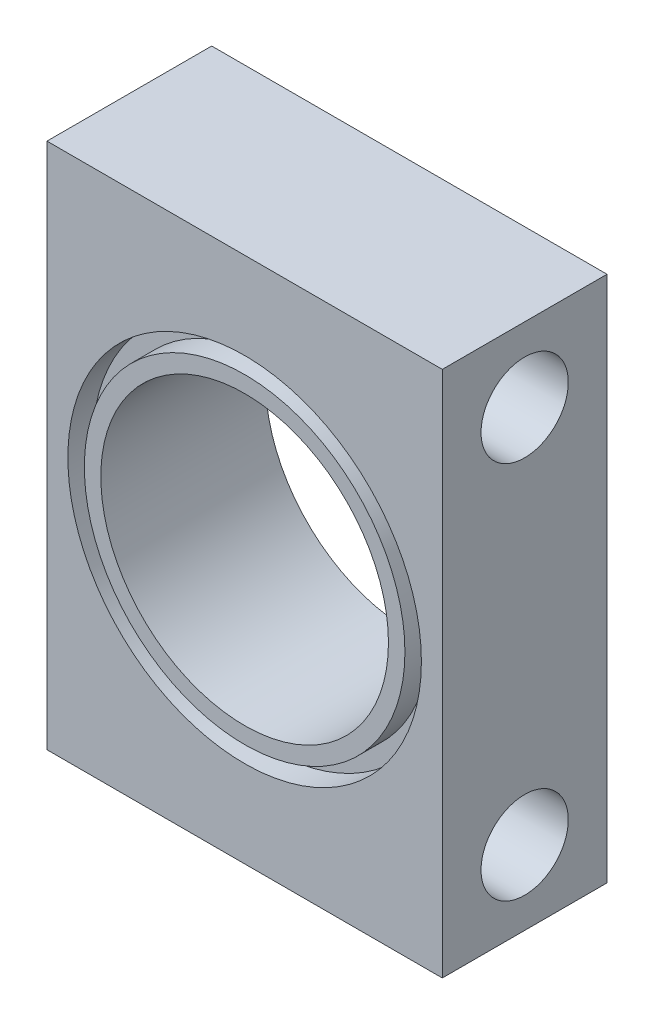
ISO-10303-21;
HEADER;
FILE_DESCRIPTION(('STEP AP214'),'2;1');
FILE_NAME('part.step','',(''),(''),'','','');
FILE_SCHEMA(('AUTOMOTIVE_DESIGN { 1 0 10303 214 1 1 1 1 }'));
ENDSEC;
DATA;
#1=APPLICATION_CONTEXT('core data for automotive mechanical design processes');
#2=APPLICATION_PROTOCOL_DEFINITION('international standard','automotive_design',2000,#1);
#3=PRODUCT_CONTEXT('',#1,'mechanical');
#4=PRODUCT('Part','Part','',(#3));
#5=PRODUCT_RELATED_PRODUCT_CATEGORY('part','',(#4));
#6=PRODUCT_DEFINITION_FORMATION('','',#4);
#7=PRODUCT_DEFINITION_CONTEXT('part definition',#1,'design');
#8=PRODUCT_DEFINITION('design','',#6,#7);
#9=PRODUCT_DEFINITION_SHAPE('','',#8);
#10=(LENGTH_UNIT() NAMED_UNIT(*) SI_UNIT(.MILLI.,.METRE.));
#11=(NAMED_UNIT(*) PLANE_ANGLE_UNIT() SI_UNIT($,.RADIAN.));
#12=(NAMED_UNIT(*) SI_UNIT($,.STERADIAN.) SOLID_ANGLE_UNIT());
#13=UNCERTAINTY_MEASURE_WITH_UNIT(LENGTH_MEASURE(1.E-05),#10,'distance_accuracy_value','');
#14=(GEOMETRIC_REPRESENTATION_CONTEXT(3) GLOBAL_UNCERTAINTY_ASSIGNED_CONTEXT((#13)) GLOBAL_UNIT_ASSIGNED_CONTEXT((#10,
#11,#12)) REPRESENTATION_CONTEXT('',''));
#15=CARTESIAN_POINT('',(0.,0.,0.));
#16=DIRECTION('',(0.,0.,1.));
#17=DIRECTION('',(1.,0.,0.));
#18=AXIS2_PLACEMENT_3D('',#15,#16,#17);
#19=CARTESIAN_POINT('',(12.,16.,5.));
#20=DIRECTION('',(0.,0.,-1.));
#21=DIRECTION('',(-1.,0.,0.));
#22=AXIS2_PLACEMENT_3D('',#19,#20,#21);
#23=PLANE('',#22);
#24=CARTESIAN_POINT('',(0.,0.,5.));
#25=DIRECTION('',(0.,0.,1.));
#26=DIRECTION('',(1.,0.,0.));
#27=AXIS2_PLACEMENT_3D('',#24,#25,#26);
#28=CIRCLE('',#27,8.73125);
#29=CARTESIAN_POINT('',(8.73125,0.,5.));
#30=VERTEX_POINT('',#29);
#31=EDGE_CURVE('E100',#30,#30,#28,.T.);
#32=ORIENTED_EDGE('',*,*,#31,.F.);
#33=EDGE_LOOP('',(#32));
#34=FACE_BOUND('',#33,.T.);
#35=CARTESIAN_POINT('',(0.,0.,5.));
#36=DIRECTION('',(0.,0.,1.));
#37=DIRECTION('',(1.,0.,0.));
#38=AXIS2_PLACEMENT_3D('',#35,#36,#37);
#39=CIRCLE('',#38,9.73125);
#40=CARTESIAN_POINT('',(9.73125,0.,5.));
#41=VERTEX_POINT('',#40);
#42=EDGE_CURVE('E140',#41,#41,#39,.T.);
#43=ORIENTED_EDGE('',*,*,#42,.T.);
#44=EDGE_LOOP('',(#43));
#45=FACE_BOUND('',#44,.T.);
#46=ADVANCED_FACE('F34',(#34,#45),#23,.F.);
#47=CARTESIAN_POINT('',(0.,0.,5.));
#48=DIRECTION('',(0.,0.,1.));
#49=DIRECTION('',(1.,0.,0.));
#50=AXIS2_PLACEMENT_3D('',#47,#48,#49);
#51=CIRCLE('',#50,10.73125);
#52=CARTESIAN_POINT('',(10.73125,0.,5.));
#53=VERTEX_POINT('',#52);
#54=EDGE_CURVE('E134',#53,#53,#51,.T.);
#55=ORIENTED_EDGE('',*,*,#54,.F.);
#56=EDGE_LOOP('',(#55));
#57=FACE_BOUND('',#56,.T.);
#58=DIRECTION('',(-1.,0.,0.));
#59=VECTOR('',#58,1.);
#60=CARTESIAN_POINT('',(0.,16.,5.));
#61=LINE('',#60,#59);
#62=CARTESIAN_POINT('',(12.,16.,5.));
#63=VERTEX_POINT('',#62);
#64=CARTESIAN_POINT('',(-12.,16.,5.));
#65=VERTEX_POINT('',#64);
#66=EDGE_CURVE('E79',#63,#65,#61,.T.);
#67=ORIENTED_EDGE('',*,*,#66,.T.);
#68=DIRECTION('',(0.,-1.,0.));
#69=VECTOR('',#68,1.);
#70=CARTESIAN_POINT('',(-12.,16.,5.));
#71=LINE('',#70,#69);
#72=CARTESIAN_POINT('',(-12.,-16.,5.));
#73=VERTEX_POINT('',#72);
#74=EDGE_CURVE('E82',#65,#73,#71,.T.);
#75=ORIENTED_EDGE('',*,*,#74,.T.);
#76=DIRECTION('',(1.,0.,0.));
#77=VECTOR('',#76,1.);
#78=CARTESIAN_POINT('',(-12.,-16.,5.));
#79=LINE('',#78,#77);
#80=CARTESIAN_POINT('',(12.,-16.,5.));
#81=VERTEX_POINT('',#80);
#82=EDGE_CURVE('E86',#73,#81,#79,.T.);
#83=ORIENTED_EDGE('',*,*,#82,.T.);
#84=DIRECTION('',(0.,1.,0.));
#85=VECTOR('',#84,1.);
#86=CARTESIAN_POINT('',(12.,16.,5.));
#87=LINE('',#86,#85);
#88=EDGE_CURVE('E51',#81,#63,#87,.T.);
#89=ORIENTED_EDGE('',*,*,#88,.T.);
#90=EDGE_LOOP('',(#67,#75,#83,#89));
#91=FACE_BOUND('',#90,.T.);
#92=ADVANCED_FACE('F84',(#57,#91),#23,.F.);
#93=CARTESIAN_POINT('',(12.,16.,-5.));
#94=DIRECTION('',(0.,0.,-1.));
#95=DIRECTION('',(-1.,0.,0.));
#96=AXIS2_PLACEMENT_3D('',#93,#94,#95);
#97=PLANE('',#96);
#98=DIRECTION('',(-1.,0.,0.));
#99=VECTOR('',#98,1.);
#100=CARTESIAN_POINT('',(0.,16.,-5.));
#101=LINE('',#100,#99);
#102=CARTESIAN_POINT('',(12.,16.,-5.));
#103=VERTEX_POINT('',#102);
#104=CARTESIAN_POINT('',(-12.,16.,-5.));
#105=VERTEX_POINT('',#104);
#106=EDGE_CURVE('E74',#103,#105,#101,.T.);
#107=ORIENTED_EDGE('',*,*,#106,.F.);
#108=DIRECTION('',(0.,1.,0.));
#109=VECTOR('',#108,1.);
#110=CARTESIAN_POINT('',(12.,16.,-5.));
#111=LINE('',#110,#109);
#112=CARTESIAN_POINT('',(12.,-16.,-5.));
#113=VERTEX_POINT('',#112);
#114=EDGE_CURVE('E103',#113,#103,#111,.T.);
#115=ORIENTED_EDGE('',*,*,#114,.F.);
#116=DIRECTION('',(1.,0.,0.));
#117=VECTOR('',#116,1.);
#118=CARTESIAN_POINT('',(0.,-16.,-5.));
#119=LINE('',#118,#117);
#120=CARTESIAN_POINT('',(-12.,-16.,-5.));
#121=VERTEX_POINT('',#120);
#122=EDGE_CURVE('E67',#121,#113,#119,.T.);
#123=ORIENTED_EDGE('',*,*,#122,.F.);
#124=DIRECTION('',(0.,-1.,0.));
#125=VECTOR('',#124,1.);
#126=CARTESIAN_POINT('',(-12.,16.,-5.));
#127=LINE('',#126,#125);
#128=EDGE_CURVE('E91',#105,#121,#127,.T.);
#129=ORIENTED_EDGE('',*,*,#128,.F.);
#130=EDGE_LOOP('',(#107,#115,#123,#129));
#131=FACE_BOUND('',#130,.T.);
#132=CARTESIAN_POINT('',(0.,0.,-5.));
#133=DIRECTION('',(0.,0.,1.));
#134=DIRECTION('',(1.,0.,0.));
#135=AXIS2_PLACEMENT_3D('',#132,#133,#134);
#136=CIRCLE('',#135,8.73125);
#137=CARTESIAN_POINT('',(8.73125,0.,-5.));
#138=VERTEX_POINT('',#137);
#139=EDGE_CURVE('E115',#138,#138,#136,.T.);
#140=ORIENTED_EDGE('',*,*,#139,.T.);
#141=EDGE_LOOP('',(#140));
#142=FACE_BOUND('',#141,.T.);
#143=ADVANCED_FACE('F109',(#131,#142),#97,.T.);
#144=CARTESIAN_POINT('',(0.,16.,5.));
#145=DIRECTION('',(0.,-1.,0.));
#146=DIRECTION('',(0.,0.,-1.));
#147=AXIS2_PLACEMENT_3D('',#144,#145,#146);
#148=PLANE('',#147);
#149=ORIENTED_EDGE('',*,*,#106,.T.);
#150=DIRECTION('',(0.,0.,-1.));
#151=VECTOR('',#150,1.);
#152=CARTESIAN_POINT('',(-12.,16.,5.));
#153=LINE('',#152,#151);
#154=EDGE_CURVE('E11',#65,#105,#153,.T.);
#155=ORIENTED_EDGE('',*,*,#154,.F.);
#156=ORIENTED_EDGE('',*,*,#66,.F.);
#157=DIRECTION('',(0.,0.,-1.));
#158=VECTOR('',#157,1.);
#159=CARTESIAN_POINT('',(12.,16.,5.));
#160=LINE('',#159,#158);
#161=EDGE_CURVE('E95',#63,#103,#160,.T.);
#162=ORIENTED_EDGE('',*,*,#161,.T.);
#163=EDGE_LOOP('',(#149,#155,#156,#162));
#164=FACE_BOUND('',#163,.T.);
#165=ADVANCED_FACE('F36',(#164),#148,.F.);
#166=CARTESIAN_POINT('',(-12.,16.,5.));
#167=DIRECTION('',(1.,0.,0.));
#168=DIRECTION('',(0.,0.,-1.));
#169=AXIS2_PLACEMENT_3D('',#166,#167,#168);
#170=PLANE('',#169);
#171=CARTESIAN_POINT('',(-12.,11.5,0.));
#172=DIRECTION('',(1.,0.,0.));
#173=DIRECTION('',(0.,0.,-1.));
#174=AXIS2_PLACEMENT_3D('',#171,#172,#173);
#175=CIRCLE('',#174,2.64999999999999);
#176=CARTESIAN_POINT('',(-12.,11.5,-2.64999999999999));
#177=VERTEX_POINT('',#176);
#178=EDGE_CURVE('E127',#177,#177,#175,.T.);
#179=ORIENTED_EDGE('',*,*,#178,.T.);
#180=EDGE_LOOP('',(#179));
#181=FACE_BOUND('',#180,.T.);
#182=CARTESIAN_POINT('',(-12.,-11.5,0.));
#183=DIRECTION('',(1.,0.,0.));
#184=DIRECTION('',(0.,0.,-1.));
#185=AXIS2_PLACEMENT_3D('',#182,#183,#184);
#186=CIRCLE('',#185,2.64999999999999);
#187=CARTESIAN_POINT('',(-12.,-11.5,-2.64999999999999));
#188=VERTEX_POINT('',#187);
#189=EDGE_CURVE('E117',#188,#188,#186,.T.);
#190=ORIENTED_EDGE('',*,*,#189,.T.);
#191=EDGE_LOOP('',(#190));
#192=FACE_BOUND('',#191,.T.);
#193=ORIENTED_EDGE('',*,*,#128,.T.);
#194=DIRECTION('',(0.,0.,-1.));
#195=VECTOR('',#194,1.);
#196=CARTESIAN_POINT('',(-12.,-16.,5.));
#197=LINE('',#196,#195);
#198=EDGE_CURVE('E43',#73,#121,#197,.T.);
#199=ORIENTED_EDGE('',*,*,#198,.F.);
#200=ORIENTED_EDGE('',*,*,#74,.F.);
#201=ORIENTED_EDGE('',*,*,#154,.T.);
#202=EDGE_LOOP('',(#193,#199,#200,#201));
#203=FACE_BOUND('',#202,.T.);
#204=ADVANCED_FACE('F90',(#181,#192,#203),#170,.F.);
#205=CARTESIAN_POINT('',(0.,-16.,5.));
#206=DIRECTION('',(0.,1.,0.));
#207=DIRECTION('',(0.,0.,1.));
#208=AXIS2_PLACEMENT_3D('',#205,#206,#207);
#209=PLANE('',#208);
#210=ORIENTED_EDGE('',*,*,#122,.T.);
#211=DIRECTION('',(0.,0.,-1.));
#212=VECTOR('',#211,1.);
#213=CARTESIAN_POINT('',(12.,-16.,5.));
#214=LINE('',#213,#212);
#215=EDGE_CURVE('E92',#81,#113,#214,.T.);
#216=ORIENTED_EDGE('',*,*,#215,.F.);
#217=ORIENTED_EDGE('',*,*,#82,.F.);
#218=ORIENTED_EDGE('',*,*,#198,.T.);
#219=EDGE_LOOP('',(#210,#216,#217,#218));
#220=FACE_BOUND('',#219,.T.);
#221=ADVANCED_FACE('F93',(#220),#209,.F.);
#222=CARTESIAN_POINT('',(12.,16.,5.));
#223=DIRECTION('',(-1.,0.,0.));
#224=DIRECTION('',(0.,-1.,0.));
#225=AXIS2_PLACEMENT_3D('',#222,#223,#224);
#226=PLANE('',#225);
#227=CARTESIAN_POINT('',(12.,11.5,0.));
#228=DIRECTION('',(-1.,0.,0.));
#229=DIRECTION('',(0.,0.,1.));
#230=AXIS2_PLACEMENT_3D('',#227,#228,#229);
#231=CIRCLE('',#230,2.64999999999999);
#232=CARTESIAN_POINT('',(12.,11.5,2.64999999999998));
#233=VERTEX_POINT('',#232);
#234=EDGE_CURVE('E130',#233,#233,#231,.T.);
#235=ORIENTED_EDGE('',*,*,#234,.T.);
#236=EDGE_LOOP('',(#235));
#237=FACE_BOUND('',#236,.T.);
#238=CARTESIAN_POINT('',(12.,-11.5,0.));
#239=DIRECTION('',(-1.,0.,0.));
#240=DIRECTION('',(0.,0.,1.));
#241=AXIS2_PLACEMENT_3D('',#238,#239,#240);
#242=CIRCLE('',#241,2.64999999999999);
#243=CARTESIAN_POINT('',(12.,-11.5,2.64999999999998));
#244=VERTEX_POINT('',#243);
#245=EDGE_CURVE('E122',#244,#244,#242,.T.);
#246=ORIENTED_EDGE('',*,*,#245,.T.);
#247=EDGE_LOOP('',(#246));
#248=FACE_BOUND('',#247,.T.);
#249=ORIENTED_EDGE('',*,*,#114,.T.);
#250=ORIENTED_EDGE('',*,*,#161,.F.);
#251=ORIENTED_EDGE('',*,*,#88,.F.);
#252=ORIENTED_EDGE('',*,*,#215,.T.);
#253=EDGE_LOOP('',(#249,#250,#251,#252));
#254=FACE_BOUND('',#253,.T.);
#255=ADVANCED_FACE('F108',(#237,#248,#254),#226,.F.);
#256=CARTESIAN_POINT('',(0.,0.,5.));
#257=DIRECTION('',(0.,0.,-1.));
#258=DIRECTION('',(-1.,0.,0.));
#259=AXIS2_PLACEMENT_3D('',#256,#257,#258);
#260=CYLINDRICAL_SURFACE('',#259,8.73125);
#261=ORIENTED_EDGE('',*,*,#31,.T.);
#262=EDGE_LOOP('',(#261));
#263=FACE_BOUND('',#262,.T.);
#264=ORIENTED_EDGE('',*,*,#139,.F.);
#265=EDGE_LOOP('',(#264));
#266=FACE_BOUND('',#265,.T.);
#267=ADVANCED_FACE('F169',(#263,#266),#260,.F.);
#268=CARTESIAN_POINT('',(-13.4,-11.5,0.));
#269=DIRECTION('',(-1.,0.,0.));
#270=DIRECTION('',(0.,0.,1.));
#271=AXIS2_PLACEMENT_3D('',#268,#269,#270);
#272=CYLINDRICAL_SURFACE('',#271,2.64999999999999);
#273=ORIENTED_EDGE('',*,*,#245,.F.);
#274=EDGE_LOOP('',(#273));
#275=FACE_BOUND('',#274,.T.);
#276=ORIENTED_EDGE('',*,*,#189,.F.);
#277=EDGE_LOOP('',(#276));
#278=FACE_BOUND('',#277,.T.);
#279=ADVANCED_FACE('F186',(#275,#278),#272,.F.);
#280=CARTESIAN_POINT('',(-13.4,11.5,0.));
#281=DIRECTION('',(-1.,0.,0.));
#282=DIRECTION('',(0.,0.,1.));
#283=AXIS2_PLACEMENT_3D('',#280,#281,#282);
#284=CYLINDRICAL_SURFACE('',#283,2.64999999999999);
#285=ORIENTED_EDGE('',*,*,#234,.F.);
#286=EDGE_LOOP('',(#285));
#287=FACE_BOUND('',#286,.T.);
#288=ORIENTED_EDGE('',*,*,#178,.F.);
#289=EDGE_LOOP('',(#288));
#290=FACE_BOUND('',#289,.T.);
#291=ADVANCED_FACE('F158',(#287,#290),#284,.F.);
#292=CARTESIAN_POINT('',(0.,0.,3.5));
#293=DIRECTION('',(0.,0.,1.));
#294=DIRECTION('',(1.,0.,0.));
#295=AXIS2_PLACEMENT_3D('',#292,#293,#294);
#296=CYLINDRICAL_SURFACE('',#295,10.73125);
#297=CARTESIAN_POINT('',(0.,0.,3.5));
#298=DIRECTION('',(0.,0.,1.));
#299=DIRECTION('',(1.,0.,0.));
#300=AXIS2_PLACEMENT_3D('',#297,#298,#299);
#301=CIRCLE('',#300,10.73125);
#302=CARTESIAN_POINT('',(10.73125,0.,3.5));
#303=VERTEX_POINT('',#302);
#304=EDGE_CURVE('E133',#303,#303,#301,.T.);
#305=ORIENTED_EDGE('',*,*,#304,.F.);
#306=EDGE_LOOP('',(#305));
#307=FACE_BOUND('',#306,.T.);
#308=ORIENTED_EDGE('',*,*,#54,.T.);
#309=EDGE_LOOP('',(#308));
#310=FACE_BOUND('',#309,.T.);
#311=ADVANCED_FACE('F152',(#307,#310),#296,.F.);
#312=CARTESIAN_POINT('',(0.,0.,3.5));
#313=DIRECTION('',(0.,0.,1.));
#314=DIRECTION('',(1.,0.,0.));
#315=AXIS2_PLACEMENT_3D('',#312,#313,#314);
#316=PLANE('',#315);
#317=CARTESIAN_POINT('',(0.,0.,3.5));
#318=DIRECTION('',(0.,0.,1.));
#319=DIRECTION('',(1.,0.,0.));
#320=AXIS2_PLACEMENT_3D('',#317,#318,#319);
#321=CIRCLE('',#320,9.73125);
#322=CARTESIAN_POINT('',(9.73125,0.,3.5));
#323=VERTEX_POINT('',#322);
#324=EDGE_CURVE('E137',#323,#323,#321,.T.);
#325=ORIENTED_EDGE('',*,*,#324,.F.);
#326=EDGE_LOOP('',(#325));
#327=FACE_BOUND('',#326,.T.);
#328=ORIENTED_EDGE('',*,*,#304,.T.);
#329=EDGE_LOOP('',(#328));
#330=FACE_BOUND('',#329,.T.);
#331=ADVANCED_FACE('F149',(#327,#330),#316,.T.);
#332=CARTESIAN_POINT('',(0.,0.,3.5));
#333=DIRECTION('',(0.,0.,1.));
#334=DIRECTION('',(1.,0.,0.));
#335=AXIS2_PLACEMENT_3D('',#332,#333,#334);
#336=CYLINDRICAL_SURFACE('',#335,9.73125);
#337=ORIENTED_EDGE('',*,*,#324,.T.);
#338=EDGE_LOOP('',(#337));
#339=FACE_BOUND('',#338,.T.);
#340=ORIENTED_EDGE('',*,*,#42,.F.);
#341=EDGE_LOOP('',(#340));
#342=FACE_BOUND('',#341,.T.);
#343=ADVANCED_FACE('F146',(#339,#342),#336,.T.);
#344=CLOSED_SHELL('',(#46,#92,#143,#165,#204,#221,#255,#267,#279,#291,#311,#331,#343));
#345=MANIFOLD_SOLID_BREP('B2',#344);
#346=ADVANCED_BREP_SHAPE_REPRESENTATION('',(#18,#345),#14);
#347=SHAPE_DEFINITION_REPRESENTATION(#9,#346);
ENDSEC;
END-ISO-10303-21;
